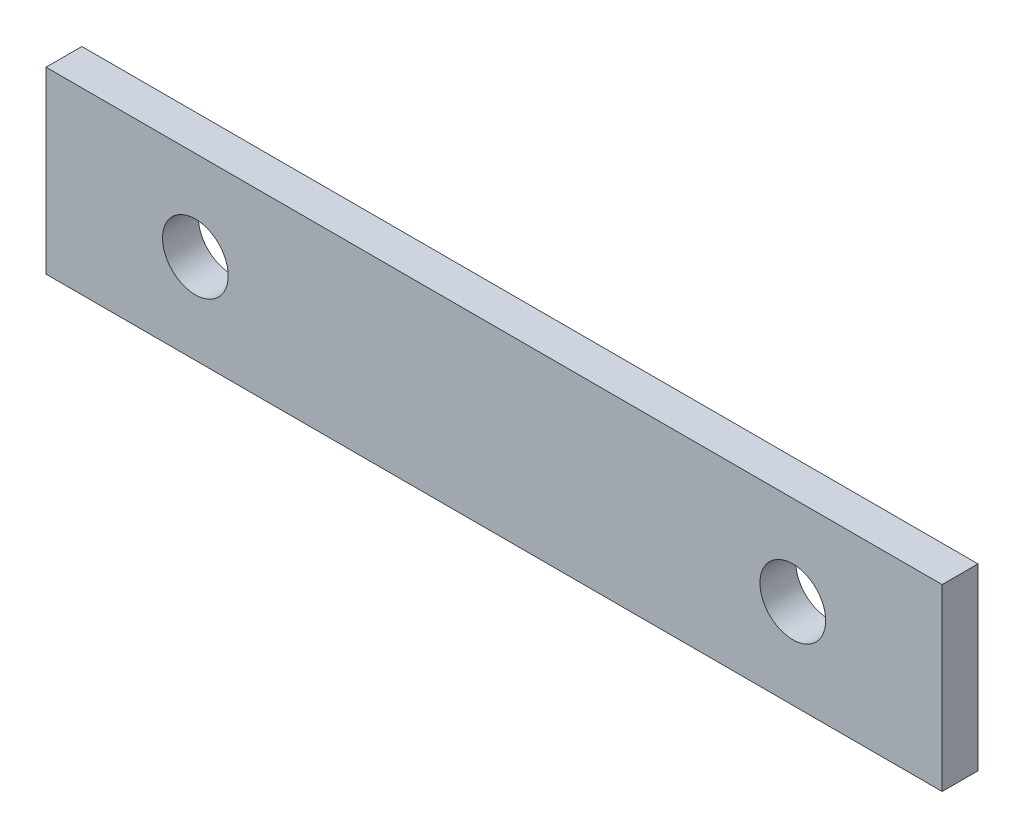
ISO-10303-21;
HEADER;
FILE_DESCRIPTION(('STEP AP214'),'2;1');
FILE_NAME('part.step','',(''),(''),'','','');
FILE_SCHEMA(('AUTOMOTIVE_DESIGN { 1 0 10303 214 1 1 1 1 }'));
ENDSEC;
DATA;
#1=APPLICATION_CONTEXT('core data for automotive mechanical design processes');
#2=APPLICATION_PROTOCOL_DEFINITION('international standard','automotive_design',2000,#1);
#3=PRODUCT_CONTEXT('',#1,'mechanical');
#4=PRODUCT('Part','Part','',(#3));
#5=PRODUCT_RELATED_PRODUCT_CATEGORY('part','',(#4));
#6=PRODUCT_DEFINITION_FORMATION('','',#4);
#7=PRODUCT_DEFINITION_CONTEXT('part definition',#1,'design');
#8=PRODUCT_DEFINITION('design','',#6,#7);
#9=PRODUCT_DEFINITION_SHAPE('','',#8);
#10=(LENGTH_UNIT() NAMED_UNIT(*) SI_UNIT(.MILLI.,.METRE.));
#11=(NAMED_UNIT(*) PLANE_ANGLE_UNIT() SI_UNIT($,.RADIAN.));
#12=(NAMED_UNIT(*) SI_UNIT($,.STERADIAN.) SOLID_ANGLE_UNIT());
#13=UNCERTAINTY_MEASURE_WITH_UNIT(LENGTH_MEASURE(1.E-05),#10,'distance_accuracy_value','');
#14=(GEOMETRIC_REPRESENTATION_CONTEXT(3) GLOBAL_UNCERTAINTY_ASSIGNED_CONTEXT((#13)) GLOBAL_UNIT_ASSIGNED_CONTEXT((#10,
#11,#12)) REPRESENTATION_CONTEXT('',''));
#15=CARTESIAN_POINT('',(0.,0.,0.));
#16=DIRECTION('',(0.,0.,1.));
#17=DIRECTION('',(1.,0.,0.));
#18=AXIS2_PLACEMENT_3D('',#15,#16,#17);
#19=CARTESIAN_POINT('',(0.,0.,12.));
#20=DIRECTION('',(0.,0.,1.));
#21=DIRECTION('',(1.,0.,0.));
#22=AXIS2_PLACEMENT_3D('',#19,#20,#21);
#23=PLANE('',#22);
#24=CARTESIAN_POINT('',(100.,0.,12.));
#25=DIRECTION('',(0.,0.,1.));
#26=DIRECTION('',(1.,0.,0.));
#27=AXIS2_PLACEMENT_3D('',#24,#25,#26);
#28=CIRCLE('',#27,11.);
#29=CARTESIAN_POINT('',(111.,0.,12.));
#30=VERTEX_POINT('',#29);
#31=EDGE_CURVE('E25',#30,#30,#28,.T.);
#32=ORIENTED_EDGE('',*,*,#31,.F.);
#33=EDGE_LOOP('',(#32));
#34=FACE_BOUND('',#33,.T.);
#35=CARTESIAN_POINT('',(-100.,0.,12.));
#36=DIRECTION('',(0.,0.,1.));
#37=DIRECTION('',(1.,0.,0.));
#38=AXIS2_PLACEMENT_3D('',#35,#36,#37);
#39=CIRCLE('',#38,11.);
#40=CARTESIAN_POINT('',(-89.,0.,12.));
#41=VERTEX_POINT('',#40);
#42=EDGE_CURVE('E81',#41,#41,#39,.T.);
#43=ORIENTED_EDGE('',*,*,#42,.F.);
#44=EDGE_LOOP('',(#43));
#45=FACE_BOUND('',#44,.T.);
#46=DIRECTION('',(1.,0.,0.));
#47=VECTOR('',#46,1.);
#48=CARTESIAN_POINT('',(-150.,-30.,12.));
#49=LINE('',#48,#47);
#50=CARTESIAN_POINT('',(-150.,-30.,12.));
#51=VERTEX_POINT('',#50);
#52=CARTESIAN_POINT('',(150.,-30.,12.));
#53=VERTEX_POINT('',#52);
#54=EDGE_CURVE('E128',#51,#53,#49,.T.);
#55=ORIENTED_EDGE('',*,*,#54,.T.);
#56=DIRECTION('',(0.,1.,0.));
#57=VECTOR('',#56,1.);
#58=CARTESIAN_POINT('',(150.,-30.,12.));
#59=LINE('',#58,#57);
#60=CARTESIAN_POINT('',(150.,30.,12.));
#61=VERTEX_POINT('',#60);
#62=EDGE_CURVE('E112',#53,#61,#59,.T.);
#63=ORIENTED_EDGE('',*,*,#62,.T.);
#64=DIRECTION('',(-1.,0.,0.));
#65=VECTOR('',#64,1.);
#66=CARTESIAN_POINT('',(150.,30.,12.));
#67=LINE('',#66,#65);
#68=CARTESIAN_POINT('',(-150.,30.,12.));
#69=VERTEX_POINT('',#68);
#70=EDGE_CURVE('E100',#61,#69,#67,.T.);
#71=ORIENTED_EDGE('',*,*,#70,.T.);
#72=DIRECTION('',(0.,-1.,0.));
#73=VECTOR('',#72,1.);
#74=CARTESIAN_POINT('',(-150.,30.,12.));
#75=LINE('',#74,#73);
#76=EDGE_CURVE('E94',#69,#51,#75,.T.);
#77=ORIENTED_EDGE('',*,*,#76,.T.);
#78=EDGE_LOOP('',(#55,#63,#71,#77));
#79=FACE_BOUND('',#78,.T.);
#80=ADVANCED_FACE('F16',(#34,#45,#79),#23,.T.);
#81=CARTESIAN_POINT('',(0.,0.,0.));
#82=DIRECTION('',(0.,0.,1.));
#83=DIRECTION('',(1.,0.,0.));
#84=AXIS2_PLACEMENT_3D('',#81,#82,#83);
#85=PLANE('',#84);
#86=CARTESIAN_POINT('',(100.,0.,0.));
#87=DIRECTION('',(0.,0.,1.));
#88=DIRECTION('',(1.,0.,0.));
#89=AXIS2_PLACEMENT_3D('',#86,#87,#88);
#90=CIRCLE('',#89,11.);
#91=CARTESIAN_POINT('',(111.,0.,0.));
#92=VERTEX_POINT('',#91);
#93=EDGE_CURVE('E10',#92,#92,#90,.T.);
#94=ORIENTED_EDGE('',*,*,#93,.T.);
#95=EDGE_LOOP('',(#94));
#96=FACE_BOUND('',#95,.T.);
#97=CARTESIAN_POINT('',(-100.,0.,0.));
#98=DIRECTION('',(0.,0.,1.));
#99=DIRECTION('',(1.,0.,0.));
#100=AXIS2_PLACEMENT_3D('',#97,#98,#99);
#101=CIRCLE('',#100,11.);
#102=CARTESIAN_POINT('',(-89.,0.,0.));
#103=VERTEX_POINT('',#102);
#104=EDGE_CURVE('E73',#103,#103,#101,.T.);
#105=ORIENTED_EDGE('',*,*,#104,.T.);
#106=EDGE_LOOP('',(#105));
#107=FACE_BOUND('',#106,.T.);
#108=DIRECTION('',(0.,-1.,0.));
#109=VECTOR('',#108,1.);
#110=CARTESIAN_POINT('',(-150.,30.,0.));
#111=LINE('',#110,#109);
#112=CARTESIAN_POINT('',(-150.,30.,0.));
#113=VERTEX_POINT('',#112);
#114=CARTESIAN_POINT('',(-150.,-30.,0.));
#115=VERTEX_POINT('',#114);
#116=EDGE_CURVE('E102',#113,#115,#111,.T.);
#117=ORIENTED_EDGE('',*,*,#116,.F.);
#118=DIRECTION('',(-1.,0.,0.));
#119=VECTOR('',#118,1.);
#120=CARTESIAN_POINT('',(150.,30.,0.));
#121=LINE('',#120,#119);
#122=CARTESIAN_POINT('',(150.,30.,0.));
#123=VERTEX_POINT('',#122);
#124=EDGE_CURVE('E110',#123,#113,#121,.T.);
#125=ORIENTED_EDGE('',*,*,#124,.F.);
#126=DIRECTION('',(0.,1.,0.));
#127=VECTOR('',#126,1.);
#128=CARTESIAN_POINT('',(150.,-30.,0.));
#129=LINE('',#128,#127);
#130=CARTESIAN_POINT('',(150.,-30.,0.));
#131=VERTEX_POINT('',#130);
#132=EDGE_CURVE('E118',#131,#123,#129,.T.);
#133=ORIENTED_EDGE('',*,*,#132,.F.);
#134=DIRECTION('',(1.,0.,0.));
#135=VECTOR('',#134,1.);
#136=CARTESIAN_POINT('',(-150.,-30.,0.));
#137=LINE('',#136,#135);
#138=EDGE_CURVE('E139',#115,#131,#137,.T.);
#139=ORIENTED_EDGE('',*,*,#138,.F.);
#140=EDGE_LOOP('',(#117,#125,#133,#139));
#141=FACE_BOUND('',#140,.T.);
#142=ADVANCED_FACE('F155',(#96,#107,#141),#85,.F.);
#143=CARTESIAN_POINT('',(100.,0.,0.));
#144=DIRECTION('',(0.,0.,-1.));
#145=DIRECTION('',(1.,0.,0.));
#146=AXIS2_PLACEMENT_3D('',#143,#144,#145);
#147=CYLINDRICAL_SURFACE('',#146,11.);
#148=DIRECTION('',(0.,0.,1.));
#149=VECTOR('',#148,1.);
#150=CARTESIAN_POINT('',(111.,0.,0.));
#151=LINE('',#150,#149);
#152=EDGE_CURVE('E91',#92,#30,#151,.T.);
#153=ORIENTED_EDGE('',*,*,#152,.T.);
#154=ORIENTED_EDGE('',*,*,#31,.T.);
#155=ORIENTED_EDGE('',*,*,#152,.F.);
#156=ORIENTED_EDGE('',*,*,#93,.F.);
#157=EDGE_LOOP('',(#153,#154,#155,#156));
#158=FACE_BOUND('',#157,.T.);
#159=ADVANCED_FACE('F175',(#158),#147,.F.);
#160=CARTESIAN_POINT('',(-100.,0.,0.));
#161=DIRECTION('',(0.,0.,-1.));
#162=DIRECTION('',(1.,0.,0.));
#163=AXIS2_PLACEMENT_3D('',#160,#161,#162);
#164=CYLINDRICAL_SURFACE('',#163,11.);
#165=DIRECTION('',(0.,0.,1.));
#166=VECTOR('',#165,1.);
#167=CARTESIAN_POINT('',(-89.,0.,0.));
#168=LINE('',#167,#166);
#169=EDGE_CURVE('E83',#103,#41,#168,.T.);
#170=ORIENTED_EDGE('',*,*,#169,.T.);
#171=ORIENTED_EDGE('',*,*,#42,.T.);
#172=ORIENTED_EDGE('',*,*,#169,.F.);
#173=ORIENTED_EDGE('',*,*,#104,.F.);
#174=EDGE_LOOP('',(#170,#171,#172,#173));
#175=FACE_BOUND('',#174,.T.);
#176=ADVANCED_FACE('F82',(#175),#164,.F.);
#177=CARTESIAN_POINT('',(-150.,30.,0.));
#178=DIRECTION('',(1.,0.,0.));
#179=DIRECTION('',(0.,1.,0.));
#180=AXIS2_PLACEMENT_3D('',#177,#178,#179);
#181=PLANE('',#180);
#182=ORIENTED_EDGE('',*,*,#116,.T.);
#183=DIRECTION('',(0.,0.,1.));
#184=VECTOR('',#183,1.);
#185=CARTESIAN_POINT('',(-150.,-30.,0.));
#186=LINE('',#185,#184);
#187=EDGE_CURVE('E124',#115,#51,#186,.T.);
#188=ORIENTED_EDGE('',*,*,#187,.T.);
#189=ORIENTED_EDGE('',*,*,#76,.F.);
#190=DIRECTION('',(0.,0.,1.));
#191=VECTOR('',#190,1.);
#192=CARTESIAN_POINT('',(-150.,30.,0.));
#193=LINE('',#192,#191);
#194=EDGE_CURVE('E98',#113,#69,#193,.T.);
#195=ORIENTED_EDGE('',*,*,#194,.F.);
#196=EDGE_LOOP('',(#182,#188,#189,#195));
#197=FACE_BOUND('',#196,.T.);
#198=ADVANCED_FACE('F161',(#197),#181,.F.);
#199=CARTESIAN_POINT('',(150.,30.,0.));
#200=DIRECTION('',(0.,-1.,0.));
#201=DIRECTION('',(0.,0.,-1.));
#202=AXIS2_PLACEMENT_3D('',#199,#200,#201);
#203=PLANE('',#202);
#204=ORIENTED_EDGE('',*,*,#124,.T.);
#205=ORIENTED_EDGE('',*,*,#194,.T.);
#206=ORIENTED_EDGE('',*,*,#70,.F.);
#207=DIRECTION('',(0.,0.,1.));
#208=VECTOR('',#207,1.);
#209=CARTESIAN_POINT('',(150.,30.,0.));
#210=LINE('',#209,#208);
#211=EDGE_CURVE('E114',#123,#61,#210,.T.);
#212=ORIENTED_EDGE('',*,*,#211,.F.);
#213=EDGE_LOOP('',(#204,#205,#206,#212));
#214=FACE_BOUND('',#213,.T.);
#215=ADVANCED_FACE('F165',(#214),#203,.F.);
#216=CARTESIAN_POINT('',(150.,-30.,0.));
#217=DIRECTION('',(-1.,0.,0.));
#218=DIRECTION('',(0.,0.,1.));
#219=AXIS2_PLACEMENT_3D('',#216,#217,#218);
#220=PLANE('',#219);
#221=ORIENTED_EDGE('',*,*,#132,.T.);
#222=ORIENTED_EDGE('',*,*,#211,.T.);
#223=ORIENTED_EDGE('',*,*,#62,.F.);
#224=DIRECTION('',(0.,0.,1.));
#225=VECTOR('',#224,1.);
#226=CARTESIAN_POINT('',(150.,-30.,0.));
#227=LINE('',#226,#225);
#228=EDGE_CURVE('E135',#131,#53,#227,.T.);
#229=ORIENTED_EDGE('',*,*,#228,.F.);
#230=EDGE_LOOP('',(#221,#222,#223,#229));
#231=FACE_BOUND('',#230,.T.);
#232=ADVANCED_FACE('F167',(#231),#220,.F.);
#233=CARTESIAN_POINT('',(-150.,-30.,0.));
#234=DIRECTION('',(0.,1.,0.));
#235=DIRECTION('',(1.,0.,0.));
#236=AXIS2_PLACEMENT_3D('',#233,#234,#235);
#237=PLANE('',#236);
#238=ORIENTED_EDGE('',*,*,#138,.T.);
#239=ORIENTED_EDGE('',*,*,#228,.T.);
#240=ORIENTED_EDGE('',*,*,#54,.F.);
#241=ORIENTED_EDGE('',*,*,#187,.F.);
#242=EDGE_LOOP('',(#238,#239,#240,#241));
#243=FACE_BOUND('',#242,.T.);
#244=ADVANCED_FACE('F149',(#243),#237,.F.);
#245=CLOSED_SHELL('',(#80,#142,#159,#176,#198,#215,#232,#244));
#246=MANIFOLD_SOLID_BREP('B1',#245);
#247=ADVANCED_BREP_SHAPE_REPRESENTATION('',(#18,#246),#14);
#248=SHAPE_DEFINITION_REPRESENTATION(#9,#247);
ENDSEC;
END-ISO-10303-21;
